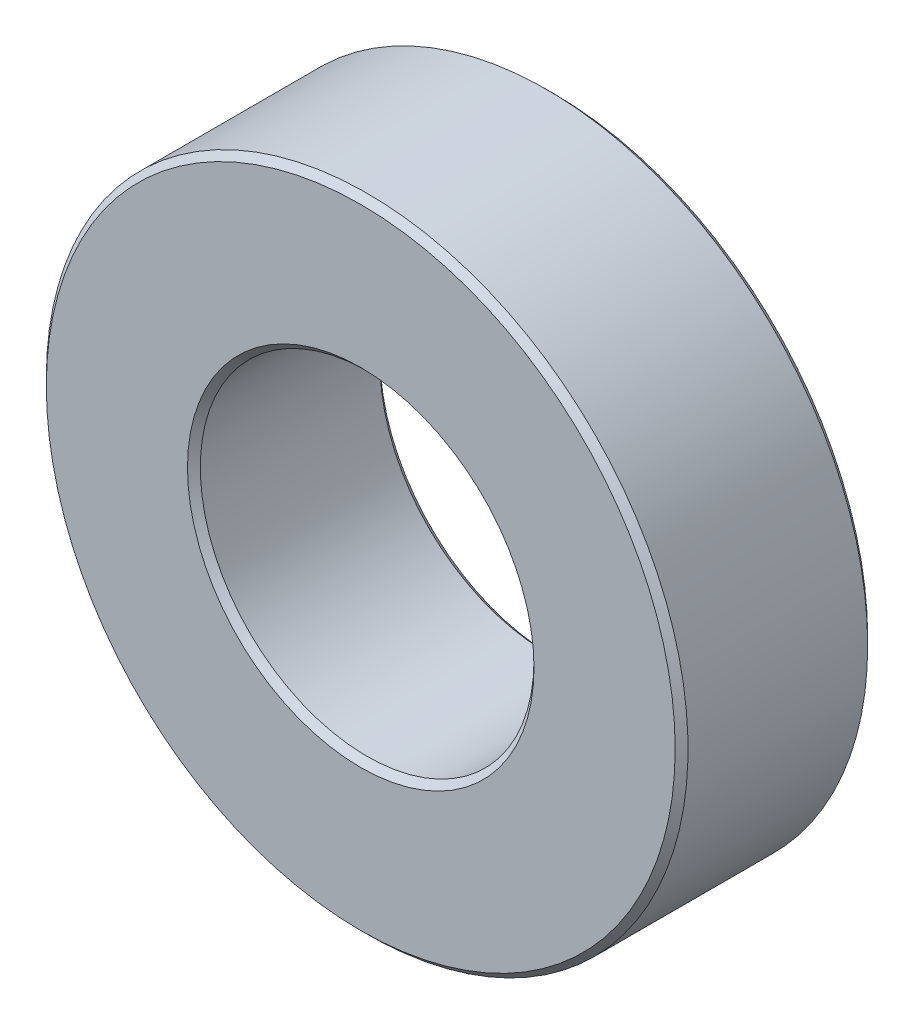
from build123d import *

# Parameters (mm, degrees)
SKETCH1_R           = 5
SKETCH1_R_2         = 2.6
BOSS_EXTRUDE2_DEPTH = 1.5
CHAMFER3_SIZE       = 0.1


with BuildPart() as part:
    # Sketch1 → Boss-Extrude2 (new, symmetric)
    with BuildSketch(Plane.XY):
        Circle(SKETCH1_R)
        Circle(SKETCH1_R_2, mode=Mode.SUBTRACT)
    extrude(amount=BOSS_EXTRUDE2_DEPTH, both=True)

    # Chamfer3
    chamfer3_edges = [part.edges().sort_by_distance(p)[0] for p in [
        (-5, 0, -1.5),
        (-5, 0, 1.5),
        (-2.6, 0, -1.5),
        (-2.6, 0, 1.5),
    ]]
    chamfer(chamfer3_edges, length=CHAMFER3_SIZE)


solid = part.part
